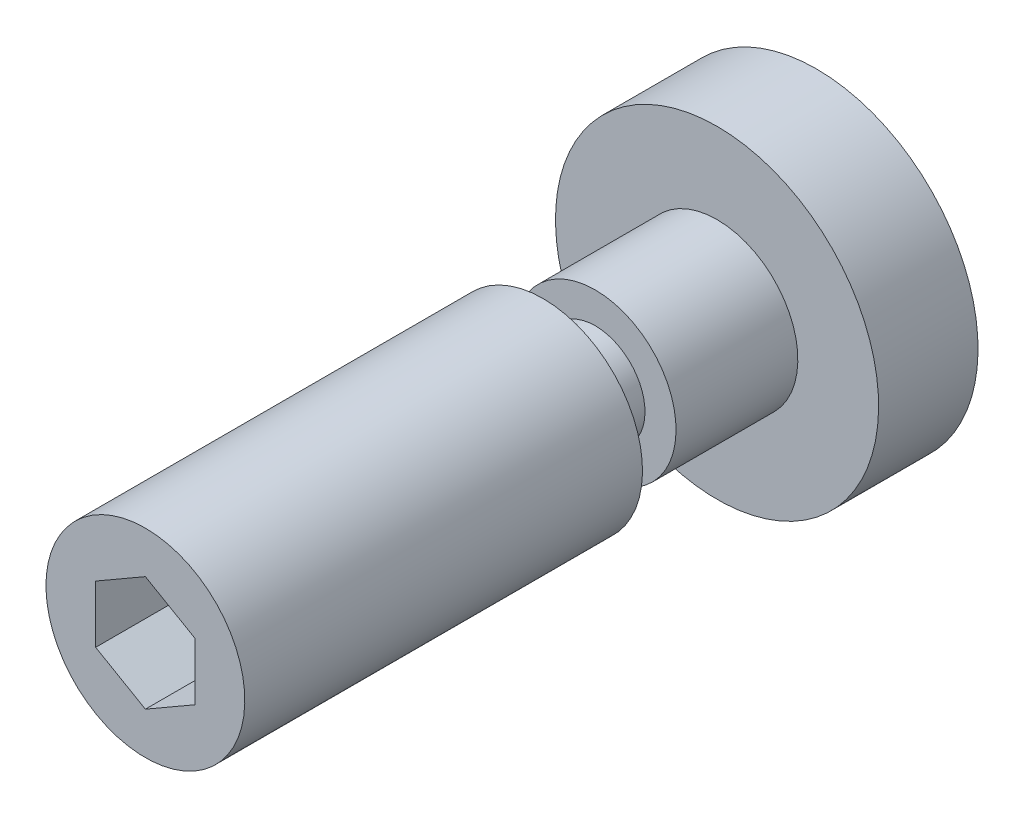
ISO-10303-21;
HEADER;
FILE_DESCRIPTION(('STEP AP214'),'2;1');
FILE_NAME('part.step','',(''),(''),'','','');
FILE_SCHEMA(('AUTOMOTIVE_DESIGN { 1 0 10303 214 1 1 1 1 }'));
ENDSEC;
DATA;
#1=APPLICATION_CONTEXT('core data for automotive mechanical design processes');
#2=APPLICATION_PROTOCOL_DEFINITION('international standard','automotive_design',2000,#1);
#3=PRODUCT_CONTEXT('',#1,'mechanical');
#4=PRODUCT('Part','Part','',(#3));
#5=PRODUCT_RELATED_PRODUCT_CATEGORY('part','',(#4));
#6=PRODUCT_DEFINITION_FORMATION('','',#4);
#7=PRODUCT_DEFINITION_CONTEXT('part definition',#1,'design');
#8=PRODUCT_DEFINITION('design','',#6,#7);
#9=PRODUCT_DEFINITION_SHAPE('','',#8);
#10=(LENGTH_UNIT() NAMED_UNIT(*) SI_UNIT(.MILLI.,.METRE.));
#11=(NAMED_UNIT(*) PLANE_ANGLE_UNIT() SI_UNIT($,.RADIAN.));
#12=(NAMED_UNIT(*) SI_UNIT($,.STERADIAN.) SOLID_ANGLE_UNIT());
#13=UNCERTAINTY_MEASURE_WITH_UNIT(LENGTH_MEASURE(1.E-05),#10,'distance_accuracy_value','');
#14=(GEOMETRIC_REPRESENTATION_CONTEXT(3) GLOBAL_UNCERTAINTY_ASSIGNED_CONTEXT((#13)) GLOBAL_UNIT_ASSIGNED_CONTEXT((#10,
#11,#12)) REPRESENTATION_CONTEXT('',''));
#15=CARTESIAN_POINT('',(0.,0.,0.));
#16=DIRECTION('',(0.,0.,1.));
#17=DIRECTION('',(1.,0.,0.));
#18=AXIS2_PLACEMENT_3D('',#15,#16,#17);
#19=CARTESIAN_POINT('',(0.,0.,0.));
#20=DIRECTION('',(0.,0.,1.));
#21=DIRECTION('',(0.,1.,0.));
#22=AXIS2_PLACEMENT_3D('',#19,#20,#21);
#23=PLANE('',#22);
#24=CARTESIAN_POINT('',(0.,0.,0.));
#25=DIRECTION('',(0.,0.,1.));
#26=DIRECTION('',(0.,1.,0.));
#27=AXIS2_PLACEMENT_3D('',#24,#25,#26);
#28=CIRCLE('',#27,6.5);
#29=CARTESIAN_POINT('',(0.,6.5,0.));
#30=VERTEX_POINT('',#29);
#31=EDGE_CURVE('E9',#30,#30,#28,.T.);
#32=ORIENTED_EDGE('',*,*,#31,.F.);
#33=EDGE_LOOP('',(#32));
#34=FACE_BOUND('',#33,.T.);
#35=ADVANCED_FACE('F14',(#34),#23,.F.);
#36=CARTESIAN_POINT('',(0.,0.,40.));
#37=DIRECTION('',(0.,0.,1.));
#38=DIRECTION('',(0.,1.,0.));
#39=AXIS2_PLACEMENT_3D('',#36,#37,#38);
#40=CYLINDRICAL_SURFACE('',#39,6.5);
#41=CARTESIAN_POINT('',(0.,0.,4.));
#42=DIRECTION('',(0.,0.,1.));
#43=DIRECTION('',(0.,1.,0.));
#44=AXIS2_PLACEMENT_3D('',#41,#42,#43);
#45=CIRCLE('',#44,6.5);
#46=CARTESIAN_POINT('',(0.,6.5,4.));
#47=VERTEX_POINT('',#46);
#48=EDGE_CURVE('E21',#47,#47,#45,.T.);
#49=ORIENTED_EDGE('',*,*,#48,.F.);
#50=EDGE_LOOP('',(#49));
#51=FACE_BOUND('',#50,.T.);
#52=ORIENTED_EDGE('',*,*,#31,.T.);
#53=EDGE_LOOP('',(#52));
#54=FACE_BOUND('',#53,.T.);
#55=ADVANCED_FACE('F142',(#51,#54),#40,.T.);
#56=CARTESIAN_POINT('',(0.,-6.5,4.));
#57=DIRECTION('',(0.,0.,-1.));
#58=DIRECTION('',(0.,-1.,0.));
#59=AXIS2_PLACEMENT_3D('',#56,#57,#58);
#60=PLANE('',#59);
#61=CARTESIAN_POINT('',(0.,0.,4.));
#62=DIRECTION('',(0.,0.,1.));
#63=DIRECTION('',(0.,1.,0.));
#64=AXIS2_PLACEMENT_3D('',#61,#62,#63);
#65=CIRCLE('',#64,3.25);
#66=CARTESIAN_POINT('',(0.,3.25,4.));
#67=VERTEX_POINT('',#66);
#68=EDGE_CURVE('E135',#67,#67,#65,.T.);
#69=ORIENTED_EDGE('',*,*,#68,.F.);
#70=EDGE_LOOP('',(#69));
#71=FACE_BOUND('',#70,.T.);
#72=ORIENTED_EDGE('',*,*,#48,.T.);
#73=EDGE_LOOP('',(#72));
#74=FACE_BOUND('',#73,.T.);
#75=ADVANCED_FACE('F140',(#71,#74),#60,.F.);
#76=CARTESIAN_POINT('',(0.,0.,40.));
#77=DIRECTION('',(0.,0.,1.));
#78=DIRECTION('',(0.,1.,0.));
#79=AXIS2_PLACEMENT_3D('',#76,#77,#78);
#80=CYLINDRICAL_SURFACE('',#79,3.25);
#81=CARTESIAN_POINT('',(0.,0.,8.9));
#82=DIRECTION('',(0.,0.,1.));
#83=DIRECTION('',(0.,1.,0.));
#84=AXIS2_PLACEMENT_3D('',#81,#82,#83);
#85=CIRCLE('',#84,3.25);
#86=CARTESIAN_POINT('',(0.,3.25,8.9));
#87=VERTEX_POINT('',#86);
#88=EDGE_CURVE('E132',#87,#87,#85,.T.);
#89=ORIENTED_EDGE('',*,*,#88,.F.);
#90=EDGE_LOOP('',(#89));
#91=FACE_BOUND('',#90,.T.);
#92=ORIENTED_EDGE('',*,*,#68,.T.);
#93=EDGE_LOOP('',(#92));
#94=FACE_BOUND('',#93,.T.);
#95=ADVANCED_FACE('F165',(#91,#94),#80,.T.);
#96=CARTESIAN_POINT('',(0.,-3.25,8.9));
#97=DIRECTION('',(0.,0.,-1.));
#98=DIRECTION('',(0.,-1.,0.));
#99=AXIS2_PLACEMENT_3D('',#96,#97,#98);
#100=PLANE('',#99);
#101=CARTESIAN_POINT('',(0.,0.,8.9));
#102=DIRECTION('',(0.,0.,1.));
#103=DIRECTION('',(0.,1.,0.));
#104=AXIS2_PLACEMENT_3D('',#101,#102,#103);
#105=CIRCLE('',#104,2.);
#106=CARTESIAN_POINT('',(0.,2.,8.9));
#107=VERTEX_POINT('',#106);
#108=EDGE_CURVE('E129',#107,#107,#105,.T.);
#109=ORIENTED_EDGE('',*,*,#108,.F.);
#110=EDGE_LOOP('',(#109));
#111=FACE_BOUND('',#110,.T.);
#112=ORIENTED_EDGE('',*,*,#88,.T.);
#113=EDGE_LOOP('',(#112));
#114=FACE_BOUND('',#113,.T.);
#115=ADVANCED_FACE('F174',(#111,#114),#100,.F.);
#116=CARTESIAN_POINT('',(0.,0.,40.));
#117=DIRECTION('',(0.,0.,1.));
#118=DIRECTION('',(0.,1.,0.));
#119=AXIS2_PLACEMENT_3D('',#116,#117,#118);
#120=CYLINDRICAL_SURFACE('',#119,2.);
#121=CARTESIAN_POINT('',(0.,0.,11.));
#122=DIRECTION('',(0.,0.,1.));
#123=DIRECTION('',(0.,1.,0.));
#124=AXIS2_PLACEMENT_3D('',#121,#122,#123);
#125=CIRCLE('',#124,2.);
#126=CARTESIAN_POINT('',(0.,2.,11.));
#127=VERTEX_POINT('',#126);
#128=EDGE_CURVE('E126',#127,#127,#125,.T.);
#129=ORIENTED_EDGE('',*,*,#128,.F.);
#130=EDGE_LOOP('',(#129));
#131=FACE_BOUND('',#130,.T.);
#132=ORIENTED_EDGE('',*,*,#108,.T.);
#133=EDGE_LOOP('',(#132));
#134=FACE_BOUND('',#133,.T.);
#135=ADVANCED_FACE('F183',(#131,#134),#120,.T.);
#136=CARTESIAN_POINT('',(0.,-2.,11.));
#137=DIRECTION('',(0.,0.,1.));
#138=DIRECTION('',(0.,1.,0.));
#139=AXIS2_PLACEMENT_3D('',#136,#137,#138);
#140=PLANE('',#139);
#141=CARTESIAN_POINT('',(0.,0.,11.));
#142=DIRECTION('',(0.,0.,1.));
#143=DIRECTION('',(0.,1.,0.));
#144=AXIS2_PLACEMENT_3D('',#141,#142,#143);
#145=CIRCLE('',#144,4.);
#146=CARTESIAN_POINT('',(0.,4.,11.));
#147=VERTEX_POINT('',#146);
#148=EDGE_CURVE('E123',#147,#147,#145,.T.);
#149=ORIENTED_EDGE('',*,*,#148,.F.);
#150=EDGE_LOOP('',(#149));
#151=FACE_BOUND('',#150,.T.);
#152=ORIENTED_EDGE('',*,*,#128,.T.);
#153=EDGE_LOOP('',(#152));
#154=FACE_BOUND('',#153,.T.);
#155=ADVANCED_FACE('F192',(#151,#154),#140,.F.);
#156=CARTESIAN_POINT('',(0.,0.,40.));
#157=DIRECTION('',(0.,0.,1.));
#158=DIRECTION('',(0.,1.,0.));
#159=AXIS2_PLACEMENT_3D('',#156,#157,#158);
#160=CYLINDRICAL_SURFACE('',#159,4.);
#161=CARTESIAN_POINT('',(0.,0.,27.));
#162=DIRECTION('',(0.,0.,1.));
#163=DIRECTION('',(0.,1.,0.));
#164=AXIS2_PLACEMENT_3D('',#161,#162,#163);
#165=CIRCLE('',#164,4.);
#166=CARTESIAN_POINT('',(0.,4.,27.));
#167=VERTEX_POINT('',#166);
#168=EDGE_CURVE('E115',#167,#167,#165,.T.);
#169=ORIENTED_EDGE('',*,*,#168,.F.);
#170=EDGE_LOOP('',(#169));
#171=FACE_BOUND('',#170,.T.);
#172=ORIENTED_EDGE('',*,*,#148,.T.);
#173=EDGE_LOOP('',(#172));
#174=FACE_BOUND('',#173,.T.);
#175=ADVANCED_FACE('F201',(#171,#174),#160,.T.);
#176=CARTESIAN_POINT('',(0.,-4.,27.));
#177=DIRECTION('',(0.,0.,-1.));
#178=DIRECTION('',(0.,-1.,0.));
#179=AXIS2_PLACEMENT_3D('',#176,#177,#178);
#180=PLANE('',#179);
#181=DIRECTION('',(-0.866025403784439,-0.5,0.));
#182=VECTOR('',#181,1.);
#183=CARTESIAN_POINT('',(0.,2.30940107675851,27.));
#184=LINE('',#183,#182);
#185=CARTESIAN_POINT('',(0.,2.30940107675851,27.));
#186=VERTEX_POINT('',#185);
#187=CARTESIAN_POINT('',(-2.,1.15470053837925,27.));
#188=VERTEX_POINT('',#187);
#189=EDGE_CURVE('E102',#186,#188,#184,.T.);
#190=ORIENTED_EDGE('',*,*,#189,.F.);
#191=DIRECTION('',(-0.866025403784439,0.5,0.));
#192=VECTOR('',#191,1.);
#193=CARTESIAN_POINT('',(2.,1.15470053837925,27.));
#194=LINE('',#193,#192);
#195=CARTESIAN_POINT('',(2.,1.15470053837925,27.));
#196=VERTEX_POINT('',#195);
#197=EDGE_CURVE('E28',#196,#186,#194,.T.);
#198=ORIENTED_EDGE('',*,*,#197,.F.);
#199=DIRECTION('',(0.,1.,0.));
#200=VECTOR('',#199,1.);
#201=CARTESIAN_POINT('',(2.,-1.15470053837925,27.));
#202=LINE('',#201,#200);
#203=CARTESIAN_POINT('',(2.,-1.15470053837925,27.));
#204=VERTEX_POINT('',#203);
#205=EDGE_CURVE('E111',#204,#196,#202,.T.);
#206=ORIENTED_EDGE('',*,*,#205,.F.);
#207=DIRECTION('',(0.866025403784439,0.5,0.));
#208=VECTOR('',#207,1.);
#209=CARTESIAN_POINT('',(0.,-2.30940107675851,27.));
#210=LINE('',#209,#208);
#211=CARTESIAN_POINT('',(0.,-2.30940107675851,27.));
#212=VERTEX_POINT('',#211);
#213=EDGE_CURVE('E109',#212,#204,#210,.T.);
#214=ORIENTED_EDGE('',*,*,#213,.F.);
#215=DIRECTION('',(0.866025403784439,-0.5,0.));
#216=VECTOR('',#215,1.);
#217=CARTESIAN_POINT('',(-2.,-1.15470053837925,27.));
#218=LINE('',#217,#216);
#219=CARTESIAN_POINT('',(-2.,-1.15470053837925,27.));
#220=VERTEX_POINT('',#219);
#221=EDGE_CURVE('E76',#220,#212,#218,.T.);
#222=ORIENTED_EDGE('',*,*,#221,.F.);
#223=DIRECTION('',(0.,-1.,0.));
#224=VECTOR('',#223,1.);
#225=CARTESIAN_POINT('',(-2.,1.15470053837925,27.));
#226=LINE('',#225,#224);
#227=EDGE_CURVE('E105',#188,#220,#226,.T.);
#228=ORIENTED_EDGE('',*,*,#227,.F.);
#229=EDGE_LOOP('',(#190,#198,#206,#214,#222,#228));
#230=FACE_BOUND('',#229,.T.);
#231=ORIENTED_EDGE('',*,*,#168,.T.);
#232=EDGE_LOOP('',(#231));
#233=FACE_BOUND('',#232,.T.);
#234=ADVANCED_FACE('F210',(#230,#233),#180,.F.);
#235=CARTESIAN_POINT('',(2.,1.15470053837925,22.));
#236=DIRECTION('',(0.5,0.866025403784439,0.));
#237=DIRECTION('',(-0.866025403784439,0.5,0.));
#238=AXIS2_PLACEMENT_3D('',#235,#236,#237);
#239=PLANE('',#238);
#240=ORIENTED_EDGE('',*,*,#197,.T.);
#241=DIRECTION('',(0.,0.,1.));
#242=VECTOR('',#241,1.);
#243=CARTESIAN_POINT('',(0.,2.30940107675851,22.));
#244=LINE('',#243,#242);
#245=CARTESIAN_POINT('',(0.,2.30940107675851,22.));
#246=VERTEX_POINT('',#245);
#247=EDGE_CURVE('E58',#246,#186,#244,.T.);
#248=ORIENTED_EDGE('',*,*,#247,.F.);
#249=DIRECTION('',(-0.866025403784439,0.5,0.));
#250=VECTOR('',#249,1.);
#251=CARTESIAN_POINT('',(2.,1.15470053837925,22.));
#252=LINE('',#251,#250);
#253=CARTESIAN_POINT('',(2.,1.15470053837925,22.));
#254=VERTEX_POINT('',#253);
#255=EDGE_CURVE('E113',#254,#246,#252,.T.);
#256=ORIENTED_EDGE('',*,*,#255,.F.);
#257=DIRECTION('',(0.,0.,1.));
#258=VECTOR('',#257,1.);
#259=CARTESIAN_POINT('',(2.,1.15470053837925,22.));
#260=LINE('',#259,#258);
#261=EDGE_CURVE('E36',#254,#196,#260,.T.);
#262=ORIENTED_EDGE('',*,*,#261,.T.);
#263=EDGE_LOOP('',(#240,#248,#256,#262));
#264=FACE_BOUND('',#263,.T.);
#265=ADVANCED_FACE('F219',(#264),#239,.F.);
#266=CARTESIAN_POINT('',(2.,-1.15470053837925,22.));
#267=DIRECTION('',(1.,0.,0.));
#268=DIRECTION('',(0.,0.,-1.));
#269=AXIS2_PLACEMENT_3D('',#266,#267,#268);
#270=PLANE('',#269);
#271=ORIENTED_EDGE('',*,*,#205,.T.);
#272=ORIENTED_EDGE('',*,*,#261,.F.);
#273=DIRECTION('',(0.,1.,0.));
#274=VECTOR('',#273,1.);
#275=CARTESIAN_POINT('',(2.,-1.15470053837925,22.));
#276=LINE('',#275,#274);
#277=CARTESIAN_POINT('',(2.,-1.15470053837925,22.));
#278=VERTEX_POINT('',#277);
#279=EDGE_CURVE('E88',#278,#254,#276,.T.);
#280=ORIENTED_EDGE('',*,*,#279,.F.);
#281=DIRECTION('',(0.,0.,1.));
#282=VECTOR('',#281,1.);
#283=CARTESIAN_POINT('',(2.,-1.15470053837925,22.));
#284=LINE('',#283,#282);
#285=EDGE_CURVE('E80',#278,#204,#284,.T.);
#286=ORIENTED_EDGE('',*,*,#285,.T.);
#287=EDGE_LOOP('',(#271,#272,#280,#286));
#288=FACE_BOUND('',#287,.T.);
#289=ADVANCED_FACE('F228',(#288),#270,.F.);
#290=CARTESIAN_POINT('',(0.,-2.30940107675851,22.));
#291=DIRECTION('',(0.5,-0.866025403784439,0.));
#292=DIRECTION('',(0.866025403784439,0.5,0.));
#293=AXIS2_PLACEMENT_3D('',#290,#291,#292);
#294=PLANE('',#293);
#295=ORIENTED_EDGE('',*,*,#213,.T.);
#296=ORIENTED_EDGE('',*,*,#285,.F.);
#297=DIRECTION('',(0.866025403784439,0.5,0.));
#298=VECTOR('',#297,1.);
#299=CARTESIAN_POINT('',(0.,-2.30940107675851,22.));
#300=LINE('',#299,#298);
#301=CARTESIAN_POINT('',(0.,-2.30940107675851,22.));
#302=VERTEX_POINT('',#301);
#303=EDGE_CURVE('E84',#302,#278,#300,.T.);
#304=ORIENTED_EDGE('',*,*,#303,.F.);
#305=DIRECTION('',(0.,0.,1.));
#306=VECTOR('',#305,1.);
#307=CARTESIAN_POINT('',(0.,-2.30940107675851,22.));
#308=LINE('',#307,#306);
#309=EDGE_CURVE('E69',#302,#212,#308,.T.);
#310=ORIENTED_EDGE('',*,*,#309,.T.);
#311=EDGE_LOOP('',(#295,#296,#304,#310));
#312=FACE_BOUND('',#311,.T.);
#313=ADVANCED_FACE('F85',(#312),#294,.F.);
#314=CARTESIAN_POINT('',(-2.,-1.15470053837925,22.));
#315=DIRECTION('',(-0.5,-0.866025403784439,0.));
#316=DIRECTION('',(0.866025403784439,-0.5,0.));
#317=AXIS2_PLACEMENT_3D('',#314,#315,#316);
#318=PLANE('',#317);
#319=ORIENTED_EDGE('',*,*,#221,.T.);
#320=ORIENTED_EDGE('',*,*,#309,.F.);
#321=DIRECTION('',(0.866025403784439,-0.5,0.));
#322=VECTOR('',#321,1.);
#323=CARTESIAN_POINT('',(-2.,-1.15470053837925,22.));
#324=LINE('',#323,#322);
#325=CARTESIAN_POINT('',(-2.,-1.15470053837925,22.));
#326=VERTEX_POINT('',#325);
#327=EDGE_CURVE('E73',#326,#302,#324,.T.);
#328=ORIENTED_EDGE('',*,*,#327,.F.);
#329=DIRECTION('',(0.,0.,1.));
#330=VECTOR('',#329,1.);
#331=CARTESIAN_POINT('',(-2.,-1.15470053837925,22.));
#332=LINE('',#331,#330);
#333=EDGE_CURVE('E81',#326,#220,#332,.T.);
#334=ORIENTED_EDGE('',*,*,#333,.T.);
#335=EDGE_LOOP('',(#319,#320,#328,#334));
#336=FACE_BOUND('',#335,.T.);
#337=ADVANCED_FACE('F71',(#336),#318,.F.);
#338=CARTESIAN_POINT('',(-2.,1.15470053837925,22.));
#339=DIRECTION('',(-1.,0.,0.));
#340=DIRECTION('',(0.,-1.,0.));
#341=AXIS2_PLACEMENT_3D('',#338,#339,#340);
#342=PLANE('',#341);
#343=ORIENTED_EDGE('',*,*,#227,.T.);
#344=ORIENTED_EDGE('',*,*,#333,.F.);
#345=DIRECTION('',(0.,-1.,0.));
#346=VECTOR('',#345,1.);
#347=CARTESIAN_POINT('',(-2.,1.15470053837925,22.));
#348=LINE('',#347,#346);
#349=CARTESIAN_POINT('',(-2.,1.15470053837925,22.));
#350=VERTEX_POINT('',#349);
#351=EDGE_CURVE('E94',#350,#326,#348,.T.);
#352=ORIENTED_EDGE('',*,*,#351,.F.);
#353=DIRECTION('',(0.,0.,1.));
#354=VECTOR('',#353,1.);
#355=CARTESIAN_POINT('',(-2.,1.15470053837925,22.));
#356=LINE('',#355,#354);
#357=EDGE_CURVE('E118',#350,#188,#356,.T.);
#358=ORIENTED_EDGE('',*,*,#357,.T.);
#359=EDGE_LOOP('',(#343,#344,#352,#358));
#360=FACE_BOUND('',#359,.T.);
#361=ADVANCED_FACE('F250',(#360),#342,.F.);
#362=CARTESIAN_POINT('',(0.,2.30940107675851,22.));
#363=DIRECTION('',(-0.5,0.866025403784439,0.));
#364=DIRECTION('',(-0.866025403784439,-0.5,0.));
#365=AXIS2_PLACEMENT_3D('',#362,#363,#364);
#366=PLANE('',#365);
#367=ORIENTED_EDGE('',*,*,#189,.T.);
#368=ORIENTED_EDGE('',*,*,#357,.F.);
#369=DIRECTION('',(-0.866025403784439,-0.5,0.));
#370=VECTOR('',#369,1.);
#371=CARTESIAN_POINT('',(0.,2.30940107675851,22.));
#372=LINE('',#371,#370);
#373=EDGE_CURVE('E96',#246,#350,#372,.T.);
#374=ORIENTED_EDGE('',*,*,#373,.F.);
#375=ORIENTED_EDGE('',*,*,#247,.T.);
#376=EDGE_LOOP('',(#367,#368,#374,#375));
#377=FACE_BOUND('',#376,.T.);
#378=ADVANCED_FACE('F258',(#377),#366,.F.);
#379=CARTESIAN_POINT('',(0.,2.30940107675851,22.));
#380=DIRECTION('',(0.,0.,1.));
#381=DIRECTION('',(1.,0.,0.));
#382=AXIS2_PLACEMENT_3D('',#379,#380,#381);
#383=PLANE('',#382);
#384=ORIENTED_EDGE('',*,*,#255,.T.);
#385=ORIENTED_EDGE('',*,*,#373,.T.);
#386=ORIENTED_EDGE('',*,*,#351,.T.);
#387=ORIENTED_EDGE('',*,*,#327,.T.);
#388=ORIENTED_EDGE('',*,*,#303,.T.);
#389=ORIENTED_EDGE('',*,*,#279,.T.);
#390=EDGE_LOOP('',(#384,#385,#386,#387,#388,#389));
#391=FACE_BOUND('',#390,.T.);
#392=ADVANCED_FACE('F91',(#391),#383,.T.);
#393=CLOSED_SHELL('',(#35,#55,#75,#95,#115,#135,#155,#175,#234,#265,#289,#313,#337,#361,#378,#392));
#394=MANIFOLD_SOLID_BREP('B1',#393);
#395=ADVANCED_BREP_SHAPE_REPRESENTATION('',(#18,#394),#14);
#396=SHAPE_DEFINITION_REPRESENTATION(#9,#395);
ENDSEC;
END-ISO-10303-21;
